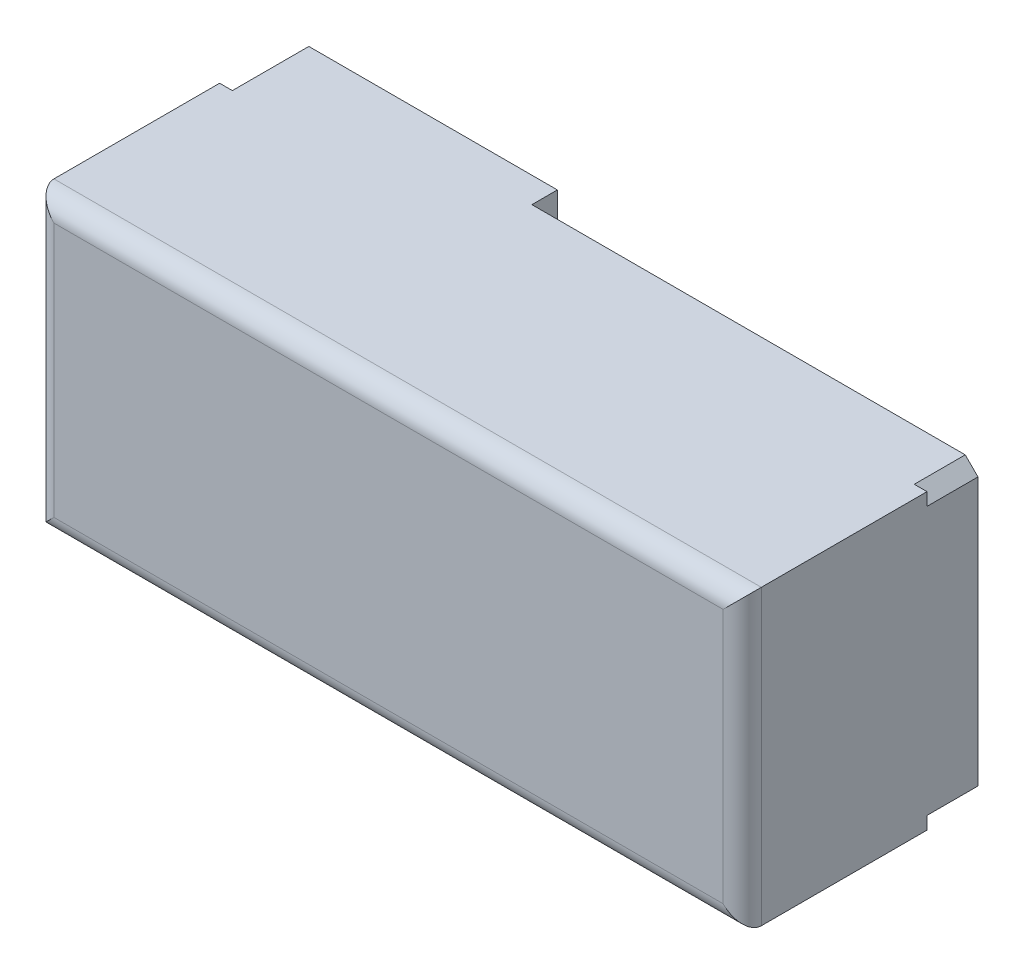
ISO-10303-21;
HEADER;
FILE_DESCRIPTION(('STEP AP214'),'2;1');
FILE_NAME('part.step','',(''),(''),'','','');
FILE_SCHEMA(('AUTOMOTIVE_DESIGN { 1 0 10303 214 1 1 1 1 }'));
ENDSEC;
DATA;
#1=APPLICATION_CONTEXT('core data for automotive mechanical design processes');
#2=APPLICATION_PROTOCOL_DEFINITION('international standard','automotive_design',2000,#1);
#3=PRODUCT_CONTEXT('',#1,'mechanical');
#4=PRODUCT('Part','Part','',(#3));
#5=PRODUCT_RELATED_PRODUCT_CATEGORY('part','',(#4));
#6=PRODUCT_DEFINITION_FORMATION('','',#4);
#7=PRODUCT_DEFINITION_CONTEXT('part definition',#1,'design');
#8=PRODUCT_DEFINITION('design','',#6,#7);
#9=PRODUCT_DEFINITION_SHAPE('','',#8);
#10=(LENGTH_UNIT() NAMED_UNIT(*) SI_UNIT(.MILLI.,.METRE.));
#11=(NAMED_UNIT(*) PLANE_ANGLE_UNIT() SI_UNIT($,.RADIAN.));
#12=(NAMED_UNIT(*) SI_UNIT($,.STERADIAN.) SOLID_ANGLE_UNIT());
#13=UNCERTAINTY_MEASURE_WITH_UNIT(LENGTH_MEASURE(1.E-05),#10,'distance_accuracy_value','');
#14=(GEOMETRIC_REPRESENTATION_CONTEXT(3) GLOBAL_UNCERTAINTY_ASSIGNED_CONTEXT((#13)) GLOBAL_UNIT_ASSIGNED_CONTEXT((#10,
#11,#12)) REPRESENTATION_CONTEXT('',''));
#15=CARTESIAN_POINT('',(0.,0.,0.));
#16=DIRECTION('',(0.,0.,1.));
#17=DIRECTION('',(1.,0.,0.));
#18=AXIS2_PLACEMENT_3D('',#15,#16,#17);
#19=CARTESIAN_POINT('',(55.5,-23.,8.));
#20=DIRECTION('',(-1.,0.,0.));
#21=DIRECTION('',(0.,0.,1.));
#22=AXIS2_PLACEMENT_3D('',#19,#20,#21);
#23=PLANE('',#22);
#24=DIRECTION('',(0.,0.,-1.));
#25=VECTOR('',#24,1.);
#26=CARTESIAN_POINT('',(55.4999999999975,22.9999999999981,37.));
#27=LINE('',#26,#25);
#28=CARTESIAN_POINT('',(55.4999999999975,22.9999999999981,34.));
#29=VERTEX_POINT('',#28);
#30=CARTESIAN_POINT('',(55.4999999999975,22.9999999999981,8.));
#31=VERTEX_POINT('',#30);
#32=EDGE_CURVE('E238',#29,#31,#27,.T.);
#33=ORIENTED_EDGE('',*,*,#32,.F.);
#34=DIRECTION('',(0.,1.,0.));
#35=VECTOR('',#34,1.);
#36=CARTESIAN_POINT('',(55.5,-22.9999999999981,34.));
#37=LINE('',#36,#35);
#38=CARTESIAN_POINT('',(55.4999999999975,-22.9999999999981,34.));
#39=VERTEX_POINT('',#38);
#40=EDGE_CURVE('E324',#29,#39,#37,.F.);
#41=ORIENTED_EDGE('',*,*,#40,.T.);
#42=DIRECTION('',(0.,0.,-1.));
#43=VECTOR('',#42,1.);
#44=CARTESIAN_POINT('',(55.4999999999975,-22.9999999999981,37.));
#45=LINE('',#44,#43);
#46=CARTESIAN_POINT('',(55.4999999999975,-22.9999999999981,8.));
#47=VERTEX_POINT('',#46);
#48=EDGE_CURVE('E181',#39,#47,#45,.T.);
#49=ORIENTED_EDGE('',*,*,#48,.T.);
#50=DIRECTION('',(0.,1.,0.));
#51=VECTOR('',#50,1.);
#52=CARTESIAN_POINT('',(55.4999999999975,22.9999999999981,8.));
#53=LINE('',#52,#51);
#54=CARTESIAN_POINT('',(55.5,-21.,8.));
#55=VERTEX_POINT('',#54);
#56=EDGE_CURVE('E203',#47,#55,#53,.T.);
#57=ORIENTED_EDGE('',*,*,#56,.T.);
#58=DIRECTION('',(0.,0.,-1.));
#59=VECTOR('',#58,1.);
#60=CARTESIAN_POINT('',(55.5,-21.,8.));
#61=LINE('',#60,#59);
#62=CARTESIAN_POINT('',(55.5,-21.,0.));
#63=VERTEX_POINT('',#62);
#64=EDGE_CURVE('E285',#55,#63,#61,.T.);
#65=ORIENTED_EDGE('',*,*,#64,.T.);
#66=DIRECTION('',(0.,1.,0.));
#67=VECTOR('',#66,1.);
#68=CARTESIAN_POINT('',(55.5,-23.,0.));
#69=LINE('',#68,#67);
#70=CARTESIAN_POINT('',(55.5,21.,0.));
#71=VERTEX_POINT('',#70);
#72=EDGE_CURVE('E438',#63,#71,#69,.T.);
#73=ORIENTED_EDGE('',*,*,#72,.T.);
#74=DIRECTION('',(0.,0.,1.));
#75=VECTOR('',#74,1.);
#76=CARTESIAN_POINT('',(55.5,21.,8.));
#77=LINE('',#76,#75);
#78=CARTESIAN_POINT('',(55.5,21.,8.));
#79=VERTEX_POINT('',#78);
#80=EDGE_CURVE('E290',#71,#79,#77,.T.);
#81=ORIENTED_EDGE('',*,*,#80,.T.);
#82=EDGE_CURVE('E197',#79,#31,#53,.T.);
#83=ORIENTED_EDGE('',*,*,#82,.T.);
#84=EDGE_LOOP('',(#33,#41,#49,#57,#65,#73,#81,#83));
#85=FACE_BOUND('',#84,.T.);
#86=ADVANCED_FACE('F38',(#85),#23,.F.);
#87=CARTESIAN_POINT('',(-55.5,23.,8.));
#88=DIRECTION('',(0.,-1.,0.));
#89=DIRECTION('',(1.,0.,0.));
#90=AXIS2_PLACEMENT_3D('',#87,#88,#89);
#91=PLANE('',#90);
#92=DIRECTION('',(0.,0.,-1.));
#93=VECTOR('',#92,1.);
#94=CARTESIAN_POINT('',(-55.4999999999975,22.9999999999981,37.));
#95=LINE('',#94,#93);
#96=CARTESIAN_POINT('',(-55.4999999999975,22.9999999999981,34.));
#97=VERTEX_POINT('',#96);
#98=CARTESIAN_POINT('',(-55.4999999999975,22.9999999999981,8.));
#99=VERTEX_POINT('',#98);
#100=EDGE_CURVE('E231',#97,#99,#95,.T.);
#101=ORIENTED_EDGE('',*,*,#100,.F.);
#102=DIRECTION('',(-1.,0.,0.));
#103=VECTOR('',#102,1.);
#104=CARTESIAN_POINT('',(55.4999999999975,23.,34.));
#105=LINE('',#104,#103);
#106=EDGE_CURVE('E328',#97,#29,#105,.F.);
#107=ORIENTED_EDGE('',*,*,#106,.T.);
#108=ORIENTED_EDGE('',*,*,#32,.T.);
#109=DIRECTION('',(-1.,0.,0.));
#110=VECTOR('',#109,1.);
#111=CARTESIAN_POINT('',(-55.4999999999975,22.9999999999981,8.));
#112=LINE('',#111,#110);
#113=CARTESIAN_POINT('',(53.5,23.,8.));
#114=VERTEX_POINT('',#113);
#115=EDGE_CURVE('E228',#31,#114,#112,.T.);
#116=ORIENTED_EDGE('',*,*,#115,.T.);
#117=DIRECTION('',(0.,0.,-1.));
#118=VECTOR('',#117,1.);
#119=CARTESIAN_POINT('',(53.5,23.,8.));
#120=LINE('',#119,#118);
#121=CARTESIAN_POINT('',(53.5,23.,0.));
#122=VERTEX_POINT('',#121);
#123=EDGE_CURVE('E289',#114,#122,#120,.T.);
#124=ORIENTED_EDGE('',*,*,#123,.T.);
#125=DIRECTION('',(-1.,0.,0.));
#126=VECTOR('',#125,1.);
#127=CARTESIAN_POINT('',(-55.5,23.,0.));
#128=LINE('',#127,#126);
#129=CARTESIAN_POINT('',(-14.5,23.,0.));
#130=VERTEX_POINT('',#129);
#131=EDGE_CURVE('E445',#122,#130,#128,.T.);
#132=ORIENTED_EDGE('',*,*,#131,.T.);
#133=DIRECTION('',(0.,0.,1.));
#134=VECTOR('',#133,1.);
#135=CARTESIAN_POINT('',(-14.5,23.,-4.));
#136=LINE('',#135,#134);
#137=CARTESIAN_POINT('',(-14.5,23.,-4.));
#138=VERTEX_POINT('',#137);
#139=EDGE_CURVE('E468',#138,#130,#136,.T.);
#140=ORIENTED_EDGE('',*,*,#139,.F.);
#141=DIRECTION('',(1.,0.,0.));
#142=VECTOR('',#141,1.);
#143=CARTESIAN_POINT('',(-14.5,23.,-4.));
#144=LINE('',#143,#142);
#145=CARTESIAN_POINT('',(-53.5,23.,-4.));
#146=VERTEX_POINT('',#145);
#147=EDGE_CURVE('E482',#146,#138,#144,.T.);
#148=ORIENTED_EDGE('',*,*,#147,.F.);
#149=DIRECTION('',(0.,0.,1.));
#150=VECTOR('',#149,1.);
#151=CARTESIAN_POINT('',(-53.5,23.,8.));
#152=LINE('',#151,#150);
#153=CARTESIAN_POINT('',(-53.5,23.,8.));
#154=VERTEX_POINT('',#153);
#155=EDGE_CURVE('E248',#146,#154,#152,.T.);
#156=ORIENTED_EDGE('',*,*,#155,.T.);
#157=EDGE_CURVE('E224',#154,#99,#112,.T.);
#158=ORIENTED_EDGE('',*,*,#157,.T.);
#159=EDGE_LOOP('',(#101,#107,#108,#116,#124,#132,#140,#148,#156,#158));
#160=FACE_BOUND('',#159,.T.);
#161=ADVANCED_FACE('F246',(#160),#91,.F.);
#162=CARTESIAN_POINT('',(-55.5,-23.,8.));
#163=DIRECTION('',(1.,0.,0.));
#164=DIRECTION('',(0.,0.,-1.));
#165=AXIS2_PLACEMENT_3D('',#162,#163,#164);
#166=PLANE('',#165);
#167=DIRECTION('',(0.,0.,-1.));
#168=VECTOR('',#167,1.);
#169=CARTESIAN_POINT('',(-55.4999999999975,-22.9999999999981,37.));
#170=LINE('',#169,#168);
#171=CARTESIAN_POINT('',(-55.4999999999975,-22.9999999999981,34.));
#172=VERTEX_POINT('',#171);
#173=CARTESIAN_POINT('',(-55.4999999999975,-22.9999999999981,8.));
#174=VERTEX_POINT('',#173);
#175=EDGE_CURVE('E174',#172,#174,#170,.T.);
#176=ORIENTED_EDGE('',*,*,#175,.F.);
#177=DIRECTION('',(0.,-1.,0.));
#178=VECTOR('',#177,1.);
#179=CARTESIAN_POINT('',(-55.5,22.9999999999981,34.));
#180=LINE('',#179,#178);
#181=EDGE_CURVE('E48',#172,#97,#180,.F.);
#182=ORIENTED_EDGE('',*,*,#181,.T.);
#183=ORIENTED_EDGE('',*,*,#100,.T.);
#184=DIRECTION('',(0.,-1.,0.));
#185=VECTOR('',#184,1.);
#186=CARTESIAN_POINT('',(-55.4999999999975,22.9999999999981,8.));
#187=LINE('',#186,#185);
#188=CARTESIAN_POINT('',(-55.4999999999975,21.0000000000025,8.));
#189=VERTEX_POINT('',#188);
#190=EDGE_CURVE('E192',#99,#189,#187,.T.);
#191=ORIENTED_EDGE('',*,*,#190,.T.);
#192=DIRECTION('',(0.,0.,-1.));
#193=VECTOR('',#192,1.);
#194=CARTESIAN_POINT('',(-55.5,21.,8.));
#195=LINE('',#194,#193);
#196=CARTESIAN_POINT('',(-55.5,21.,-4.));
#197=VERTEX_POINT('',#196);
#198=EDGE_CURVE('E308',#189,#197,#195,.T.);
#199=ORIENTED_EDGE('',*,*,#198,.T.);
#200=DIRECTION('',(0.,1.,0.));
#201=VECTOR('',#200,1.);
#202=CARTESIAN_POINT('',(-55.5,21.,-4.));
#203=LINE('',#202,#201);
#204=CARTESIAN_POINT('',(-55.5,-21.,-4.));
#205=VERTEX_POINT('',#204);
#206=EDGE_CURVE('E802',#205,#197,#203,.T.);
#207=ORIENTED_EDGE('',*,*,#206,.F.);
#208=DIRECTION('',(0.,0.,1.));
#209=VECTOR('',#208,1.);
#210=CARTESIAN_POINT('',(-55.5,-21.,8.));
#211=LINE('',#210,#209);
#212=CARTESIAN_POINT('',(-55.5,-21.,8.));
#213=VERTEX_POINT('',#212);
#214=EDGE_CURVE('E187',#205,#213,#211,.T.);
#215=ORIENTED_EDGE('',*,*,#214,.T.);
#216=EDGE_CURVE('E184',#213,#174,#187,.T.);
#217=ORIENTED_EDGE('',*,*,#216,.T.);
#218=EDGE_LOOP('',(#176,#182,#183,#191,#199,#207,#215,#217));
#219=FACE_BOUND('',#218,.T.);
#220=ADVANCED_FACE('F185',(#219),#166,.F.);
#221=CARTESIAN_POINT('',(-55.5,-23.,8.));
#222=DIRECTION('',(0.,1.,0.));
#223=DIRECTION('',(-1.,0.,0.));
#224=AXIS2_PLACEMENT_3D('',#221,#222,#223);
#225=PLANE('',#224);
#226=ORIENTED_EDGE('',*,*,#48,.F.);
#227=DIRECTION('',(1.,0.,0.));
#228=VECTOR('',#227,1.);
#229=CARTESIAN_POINT('',(-55.4999999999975,-23.,34.));
#230=LINE('',#229,#228);
#231=EDGE_CURVE('E11',#39,#172,#230,.F.);
#232=ORIENTED_EDGE('',*,*,#231,.T.);
#233=ORIENTED_EDGE('',*,*,#175,.T.);
#234=DIRECTION('',(1.,0.,0.));
#235=VECTOR('',#234,1.);
#236=CARTESIAN_POINT('',(-55.4999999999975,-22.9999999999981,8.));
#237=LINE('',#236,#235);
#238=CARTESIAN_POINT('',(-53.5,-23.,8.));
#239=VERTEX_POINT('',#238);
#240=EDGE_CURVE('E178',#174,#239,#237,.T.);
#241=ORIENTED_EDGE('',*,*,#240,.T.);
#242=DIRECTION('',(0.,0.,-1.));
#243=VECTOR('',#242,1.);
#244=CARTESIAN_POINT('',(-53.5,-23.,8.));
#245=LINE('',#244,#243);
#246=CARTESIAN_POINT('',(-53.5,-23.,-4.));
#247=VERTEX_POINT('',#246);
#248=EDGE_CURVE('E296',#239,#247,#245,.T.);
#249=ORIENTED_EDGE('',*,*,#248,.T.);
#250=DIRECTION('',(-1.,0.,0.));
#251=VECTOR('',#250,1.);
#252=CARTESIAN_POINT('',(-14.5,-23.,-4.));
#253=LINE('',#252,#251);
#254=CARTESIAN_POINT('',(-14.5,-23.,-4.));
#255=VERTEX_POINT('',#254);
#256=EDGE_CURVE('E794',#255,#247,#253,.T.);
#257=ORIENTED_EDGE('',*,*,#256,.F.);
#258=DIRECTION('',(0.,0.,1.));
#259=VECTOR('',#258,1.);
#260=CARTESIAN_POINT('',(-14.5,-23.,-4.));
#261=LINE('',#260,#259);
#262=CARTESIAN_POINT('',(-14.5,-23.,0.));
#263=VERTEX_POINT('',#262);
#264=EDGE_CURVE('E464',#255,#263,#261,.T.);
#265=ORIENTED_EDGE('',*,*,#264,.T.);
#266=DIRECTION('',(1.,0.,0.));
#267=VECTOR('',#266,1.);
#268=CARTESIAN_POINT('',(-55.5,-23.,0.));
#269=LINE('',#268,#267);
#270=CARTESIAN_POINT('',(53.5,-23.,0.));
#271=VERTEX_POINT('',#270);
#272=EDGE_CURVE('E297',#263,#271,#269,.T.);
#273=ORIENTED_EDGE('',*,*,#272,.T.);
#274=DIRECTION('',(0.,0.,1.));
#275=VECTOR('',#274,1.);
#276=CARTESIAN_POINT('',(53.5,-23.,8.));
#277=LINE('',#276,#275);
#278=CARTESIAN_POINT('',(53.5,-23.,8.));
#279=VERTEX_POINT('',#278);
#280=EDGE_CURVE('E293',#271,#279,#277,.T.);
#281=ORIENTED_EDGE('',*,*,#280,.T.);
#282=EDGE_CURVE('E198',#279,#47,#237,.T.);
#283=ORIENTED_EDGE('',*,*,#282,.T.);
#284=EDGE_LOOP('',(#226,#232,#233,#241,#249,#257,#265,#273,#281,#283));
#285=FACE_BOUND('',#284,.T.);
#286=ADVANCED_FACE('F176',(#285),#225,.F.);
#287=CARTESIAN_POINT('',(55.5,23.,0.));
#288=DIRECTION('',(0.,0.,-1.));
#289=DIRECTION('',(-1.,0.,0.));
#290=AXIS2_PLACEMENT_3D('',#287,#288,#289);
#291=PLANE('',#290);
#292=DIRECTION('',(0.,-1.,0.));
#293=VECTOR('',#292,1.);
#294=CARTESIAN_POINT('',(-14.5,23.,0.));
#295=LINE('',#294,#293);
#296=EDGE_CURVE('E471',#130,#263,#295,.T.);
#297=ORIENTED_EDGE('',*,*,#296,.F.);
#298=ORIENTED_EDGE('',*,*,#131,.F.);
#299=DIRECTION('',(-0.707106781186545,0.70710678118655,0.));
#300=VECTOR('',#299,1.);
#301=CARTESIAN_POINT('',(54.5,22.,0.));
#302=LINE('',#301,#300);
#303=EDGE_CURVE('E303',#122,#71,#302,.F.);
#304=ORIENTED_EDGE('',*,*,#303,.T.);
#305=ORIENTED_EDGE('',*,*,#72,.F.);
#306=DIRECTION('',(0.70710678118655,0.707106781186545,0.));
#307=VECTOR('',#306,1.);
#308=CARTESIAN_POINT('',(77.5,0.999999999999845,0.));
#309=LINE('',#308,#307);
#310=EDGE_CURVE('E435',#63,#271,#309,.F.);
#311=ORIENTED_EDGE('',*,*,#310,.T.);
#312=ORIENTED_EDGE('',*,*,#272,.F.);
#313=EDGE_LOOP('',(#297,#298,#304,#305,#311,#312));
#314=FACE_BOUND('',#313,.T.);
#315=CARTESIAN_POINT('',(19.,0.,0.));
#316=DIRECTION('',(0.,0.,1.));
#317=DIRECTION('',(1.,0.,0.));
#318=AXIS2_PLACEMENT_3D('',#315,#316,#317);
#319=CIRCLE('',#318,5.);
#320=CARTESIAN_POINT('',(19.,5.,0.));
#321=VERTEX_POINT('',#320);
#322=CARTESIAN_POINT('',(19.,-5.,0.));
#323=VERTEX_POINT('',#322);
#324=EDGE_CURVE('E484',#321,#323,#319,.T.);
#325=ORIENTED_EDGE('',*,*,#324,.T.);
#326=DIRECTION('',(1.,0.,0.));
#327=VECTOR('',#326,1.);
#328=CARTESIAN_POINT('',(19.,-5.,0.));
#329=LINE('',#328,#327);
#330=CARTESIAN_POINT('',(29.,-5.,0.));
#331=VERTEX_POINT('',#330);
#332=EDGE_CURVE('E488',#323,#331,#329,.T.);
#333=ORIENTED_EDGE('',*,*,#332,.T.);
#334=CARTESIAN_POINT('',(29.,0.,0.));
#335=DIRECTION('',(0.,0.,1.));
#336=DIRECTION('',(1.,0.,0.));
#337=AXIS2_PLACEMENT_3D('',#334,#335,#336);
#338=CIRCLE('',#337,5.);
#339=CARTESIAN_POINT('',(29.,5.,0.));
#340=VERTEX_POINT('',#339);
#341=EDGE_CURVE('E493',#331,#340,#338,.T.);
#342=ORIENTED_EDGE('',*,*,#341,.T.);
#343=DIRECTION('',(-1.,0.,0.));
#344=VECTOR('',#343,1.);
#345=CARTESIAN_POINT('',(19.,5.,0.));
#346=LINE('',#345,#344);
#347=EDGE_CURVE('E497',#340,#321,#346,.T.);
#348=ORIENTED_EDGE('',*,*,#347,.T.);
#349=EDGE_LOOP('',(#325,#333,#342,#348));
#350=FACE_BOUND('',#349,.T.);
#351=ADVANCED_FACE('F441',(#314,#350),#291,.T.);
#352=CARTESIAN_POINT('',(-34.5,0.,0.));
#353=DIRECTION('',(0.,0.,1.));
#354=DIRECTION('',(1.,0.,0.));
#355=AXIS2_PLACEMENT_3D('',#352,#353,#354);
#356=CYLINDRICAL_SURFACE('',#355,7.5);
#357=CARTESIAN_POINT('',(-34.5,0.,0.));
#358=DIRECTION('',(0.,0.,1.));
#359=DIRECTION('',(1.,0.,0.));
#360=AXIS2_PLACEMENT_3D('',#357,#358,#359);
#361=CIRCLE('',#360,7.5);
#362=CARTESIAN_POINT('',(-27.,0.,0.));
#363=VERTEX_POINT('',#362);
#364=EDGE_CURVE('E477',#363,#363,#361,.F.);
#365=ORIENTED_EDGE('',*,*,#364,.T.);
#366=EDGE_LOOP('',(#365));
#367=FACE_BOUND('',#366,.T.);
#368=CARTESIAN_POINT('',(-34.5,0.,8.));
#369=DIRECTION('',(0.,0.,1.));
#370=DIRECTION('',(1.,0.,0.));
#371=AXIS2_PLACEMENT_3D('',#368,#369,#370);
#372=CIRCLE('',#371,7.5);
#373=CARTESIAN_POINT('',(-27.,0.,8.));
#374=VERTEX_POINT('',#373);
#375=EDGE_CURVE('E180',#374,#374,#372,.T.);
#376=ORIENTED_EDGE('',*,*,#375,.T.);
#377=EDGE_LOOP('',(#376));
#378=FACE_BOUND('',#377,.T.);
#379=ADVANCED_FACE('F542',(#367,#378),#356,.F.);
#380=CARTESIAN_POINT('',(19.,0.,0.));
#381=DIRECTION('',(0.,0.,1.));
#382=DIRECTION('',(1.,0.,0.));
#383=AXIS2_PLACEMENT_3D('',#380,#381,#382);
#384=CYLINDRICAL_SURFACE('',#383,5.);
#385=CARTESIAN_POINT('',(19.,0.,8.));
#386=DIRECTION('',(0.,0.,1.));
#387=DIRECTION('',(1.,0.,0.));
#388=AXIS2_PLACEMENT_3D('',#385,#386,#387);
#389=CIRCLE('',#388,5.);
#390=CARTESIAN_POINT('',(19.,5.,8.));
#391=VERTEX_POINT('',#390);
#392=CARTESIAN_POINT('',(19.,-5.,8.));
#393=VERTEX_POINT('',#392);
#394=EDGE_CURVE('E467',#391,#393,#389,.T.);
#395=ORIENTED_EDGE('',*,*,#394,.T.);
#396=DIRECTION('',(0.,0.,1.));
#397=VECTOR('',#396,1.);
#398=CARTESIAN_POINT('',(19.,-5.,0.));
#399=LINE('',#398,#397);
#400=EDGE_CURVE('E501',#323,#393,#399,.T.);
#401=ORIENTED_EDGE('',*,*,#400,.F.);
#402=ORIENTED_EDGE('',*,*,#324,.F.);
#403=DIRECTION('',(0.,0.,1.));
#404=VECTOR('',#403,1.);
#405=CARTESIAN_POINT('',(19.,5.,0.));
#406=LINE('',#405,#404);
#407=EDGE_CURVE('E446',#321,#391,#406,.T.);
#408=ORIENTED_EDGE('',*,*,#407,.T.);
#409=EDGE_LOOP('',(#395,#401,#402,#408));
#410=FACE_BOUND('',#409,.T.);
#411=ADVANCED_FACE('F529',(#410),#384,.F.);
#412=CARTESIAN_POINT('',(19.,5.,0.));
#413=DIRECTION('',(0.,1.,0.));
#414=DIRECTION('',(0.,0.,1.));
#415=AXIS2_PLACEMENT_3D('',#412,#413,#414);
#416=PLANE('',#415);
#417=DIRECTION('',(-1.,0.,0.));
#418=VECTOR('',#417,1.);
#419=CARTESIAN_POINT('',(19.,5.,8.));
#420=LINE('',#419,#418);
#421=CARTESIAN_POINT('',(29.,5.,8.));
#422=VERTEX_POINT('',#421);
#423=EDGE_CURVE('E489',#422,#391,#420,.T.);
#424=ORIENTED_EDGE('',*,*,#423,.T.);
#425=ORIENTED_EDGE('',*,*,#407,.F.);
#426=ORIENTED_EDGE('',*,*,#347,.F.);
#427=DIRECTION('',(0.,0.,1.));
#428=VECTOR('',#427,1.);
#429=CARTESIAN_POINT('',(29.,5.,0.));
#430=LINE('',#429,#428);
#431=EDGE_CURVE('E454',#340,#422,#430,.T.);
#432=ORIENTED_EDGE('',*,*,#431,.T.);
#433=EDGE_LOOP('',(#424,#425,#426,#432));
#434=FACE_BOUND('',#433,.T.);
#435=ADVANCED_FACE('F534',(#434),#416,.F.);
#436=CARTESIAN_POINT('',(29.,0.,0.));
#437=DIRECTION('',(0.,0.,1.));
#438=DIRECTION('',(1.,0.,0.));
#439=AXIS2_PLACEMENT_3D('',#436,#437,#438);
#440=CYLINDRICAL_SURFACE('',#439,5.);
#441=CARTESIAN_POINT('',(29.,0.,8.));
#442=DIRECTION('',(0.,0.,1.));
#443=DIRECTION('',(1.,0.,0.));
#444=AXIS2_PLACEMENT_3D('',#441,#442,#443);
#445=CIRCLE('',#444,5.);
#446=CARTESIAN_POINT('',(29.,-5.,8.));
#447=VERTEX_POINT('',#446);
#448=EDGE_CURVE('E509',#447,#422,#445,.T.);
#449=ORIENTED_EDGE('',*,*,#448,.T.);
#450=ORIENTED_EDGE('',*,*,#431,.F.);
#451=ORIENTED_EDGE('',*,*,#341,.F.);
#452=DIRECTION('',(0.,0.,1.));
#453=VECTOR('',#452,1.);
#454=CARTESIAN_POINT('',(29.,-5.,0.));
#455=LINE('',#454,#453);
#456=EDGE_CURVE('E519',#331,#447,#455,.T.);
#457=ORIENTED_EDGE('',*,*,#456,.T.);
#458=EDGE_LOOP('',(#449,#450,#451,#457));
#459=FACE_BOUND('',#458,.T.);
#460=ADVANCED_FACE('F531',(#459),#440,.F.);
#461=CARTESIAN_POINT('',(19.,-5.,0.));
#462=DIRECTION('',(0.,-1.,0.));
#463=DIRECTION('',(0.,0.,-1.));
#464=AXIS2_PLACEMENT_3D('',#461,#462,#463);
#465=PLANE('',#464);
#466=DIRECTION('',(1.,0.,0.));
#467=VECTOR('',#466,1.);
#468=CARTESIAN_POINT('',(19.,-5.,8.));
#469=LINE('',#468,#467);
#470=EDGE_CURVE('E505',#393,#447,#469,.T.);
#471=ORIENTED_EDGE('',*,*,#470,.T.);
#472=ORIENTED_EDGE('',*,*,#456,.F.);
#473=ORIENTED_EDGE('',*,*,#332,.F.);
#474=ORIENTED_EDGE('',*,*,#400,.T.);
#475=EDGE_LOOP('',(#471,#472,#473,#474));
#476=FACE_BOUND('',#475,.T.);
#477=ADVANCED_FACE('F389',(#476),#465,.F.);
#478=CARTESIAN_POINT('',(-53.5,-23.,8.));
#479=DIRECTION('',(0.70710678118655,0.707106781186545,0.));
#480=DIRECTION('',(-0.707106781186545,0.70710678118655,0.));
#481=AXIS2_PLACEMENT_3D('',#478,#479,#480);
#482=PLANE('',#481);
#483=DIRECTION('',(-0.707106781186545,0.70710678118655,0.));
#484=VECTOR('',#483,1.);
#485=CARTESIAN_POINT('',(-53.5,-23.,8.));
#486=LINE('',#485,#484);
#487=EDGE_CURVE('E195',#213,#239,#486,.F.);
#488=ORIENTED_EDGE('',*,*,#487,.F.);
#489=ORIENTED_EDGE('',*,*,#214,.F.);
#490=DIRECTION('',(-0.707106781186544,0.707106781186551,0.));
#491=VECTOR('',#490,1.);
#492=CARTESIAN_POINT('',(-55.5,-21.,-4.));
#493=LINE('',#492,#491);
#494=EDGE_CURVE('E798',#247,#205,#493,.T.);
#495=ORIENTED_EDGE('',*,*,#494,.F.);
#496=ORIENTED_EDGE('',*,*,#248,.F.);
#497=EDGE_LOOP('',(#488,#489,#495,#496));
#498=FACE_BOUND('',#497,.T.);
#499=ADVANCED_FACE('F385',(#498),#482,.F.);
#500=CARTESIAN_POINT('',(55.5,-21.,8.));
#501=DIRECTION('',(-0.707106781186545,0.70710678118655,0.));
#502=DIRECTION('',(-0.70710678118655,-0.707106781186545,0.));
#503=AXIS2_PLACEMENT_3D('',#500,#501,#502);
#504=PLANE('',#503);
#505=DIRECTION('',(-0.70710678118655,-0.707106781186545,0.));
#506=VECTOR('',#505,1.);
#507=CARTESIAN_POINT('',(55.5,-21.,8.));
#508=LINE('',#507,#506);
#509=EDGE_CURVE('E256',#279,#55,#508,.F.);
#510=ORIENTED_EDGE('',*,*,#509,.F.);
#511=ORIENTED_EDGE('',*,*,#280,.F.);
#512=ORIENTED_EDGE('',*,*,#310,.F.);
#513=ORIENTED_EDGE('',*,*,#64,.F.);
#514=EDGE_LOOP('',(#510,#511,#512,#513));
#515=FACE_BOUND('',#514,.T.);
#516=ADVANCED_FACE('F388',(#515),#504,.F.);
#517=CARTESIAN_POINT('',(-55.5,21.,8.));
#518=DIRECTION('',(0.707106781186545,-0.70710678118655,0.));
#519=DIRECTION('',(0.70710678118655,0.707106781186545,0.));
#520=AXIS2_PLACEMENT_3D('',#517,#518,#519);
#521=PLANE('',#520);
#522=DIRECTION('',(0.70710678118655,0.707106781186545,0.));
#523=VECTOR('',#522,1.);
#524=CARTESIAN_POINT('',(-55.5,21.,8.));
#525=LINE('',#524,#523);
#526=EDGE_CURVE('E253',#154,#189,#525,.F.);
#527=ORIENTED_EDGE('',*,*,#526,.F.);
#528=ORIENTED_EDGE('',*,*,#155,.F.);
#529=DIRECTION('',(0.707106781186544,0.707106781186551,0.));
#530=VECTOR('',#529,1.);
#531=CARTESIAN_POINT('',(-55.5,21.,-4.));
#532=LINE('',#531,#530);
#533=EDGE_CURVE('E805',#197,#146,#532,.T.);
#534=ORIENTED_EDGE('',*,*,#533,.F.);
#535=ORIENTED_EDGE('',*,*,#198,.F.);
#536=EDGE_LOOP('',(#527,#528,#534,#535));
#537=FACE_BOUND('',#536,.T.);
#538=ADVANCED_FACE('F393',(#537),#521,.F.);
#539=CARTESIAN_POINT('',(53.5,23.,8.));
#540=DIRECTION('',(-0.70710678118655,-0.707106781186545,0.));
#541=DIRECTION('',(0.707106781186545,-0.70710678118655,0.));
#542=AXIS2_PLACEMENT_3D('',#539,#540,#541);
#543=PLANE('',#542);
#544=DIRECTION('',(0.707106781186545,-0.70710678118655,0.));
#545=VECTOR('',#544,1.);
#546=CARTESIAN_POINT('',(53.5,23.,8.));
#547=LINE('',#546,#545);
#548=EDGE_CURVE('E257',#79,#114,#547,.F.);
#549=ORIENTED_EDGE('',*,*,#548,.F.);
#550=ORIENTED_EDGE('',*,*,#80,.F.);
#551=ORIENTED_EDGE('',*,*,#303,.F.);
#552=ORIENTED_EDGE('',*,*,#123,.F.);
#553=EDGE_LOOP('',(#549,#550,#551,#552));
#554=FACE_BOUND('',#553,.T.);
#555=ADVANCED_FACE('F397',(#554),#543,.F.);
#556=CARTESIAN_POINT('',(0.,0.,-4.));
#557=DIRECTION('',(0.,0.,-1.));
#558=DIRECTION('',(-1.,0.,0.));
#559=AXIS2_PLACEMENT_3D('',#556,#557,#558);
#560=PLANE('',#559);
#561=CARTESIAN_POINT('',(-34.5,0.,-4.));
#562=DIRECTION('',(0.,0.,-1.));
#563=DIRECTION('',(-1.,0.,0.));
#564=AXIS2_PLACEMENT_3D('',#561,#562,#563);
#565=CIRCLE('',#564,15.1);
#566=CARTESIAN_POINT('',(-49.6,0.,-4.));
#567=VERTEX_POINT('',#566);
#568=EDGE_CURVE('E784',#567,#567,#565,.T.);
#569=ORIENTED_EDGE('',*,*,#568,.F.);
#570=EDGE_LOOP('',(#569));
#571=FACE_BOUND('',#570,.T.);
#572=DIRECTION('',(0.,-1.,0.));
#573=VECTOR('',#572,1.);
#574=CARTESIAN_POINT('',(-14.5,23.,-4.));
#575=LINE('',#574,#573);
#576=EDGE_CURVE('E476',#138,#255,#575,.T.);
#577=ORIENTED_EDGE('',*,*,#576,.T.);
#578=ORIENTED_EDGE('',*,*,#256,.T.);
#579=ORIENTED_EDGE('',*,*,#494,.T.);
#580=ORIENTED_EDGE('',*,*,#206,.T.);
#581=ORIENTED_EDGE('',*,*,#533,.T.);
#582=ORIENTED_EDGE('',*,*,#147,.T.);
#583=EDGE_LOOP('',(#577,#578,#579,#580,#581,#582));
#584=FACE_BOUND('',#583,.T.);
#585=ADVANCED_FACE('F400',(#571,#584),#560,.T.);
#586=CARTESIAN_POINT('',(-14.5,23.,-4.));
#587=DIRECTION('',(-1.,0.,0.));
#588=DIRECTION('',(0.,-1.,0.));
#589=AXIS2_PLACEMENT_3D('',#586,#587,#588);
#590=PLANE('',#589);
#591=ORIENTED_EDGE('',*,*,#296,.T.);
#592=ORIENTED_EDGE('',*,*,#264,.F.);
#593=ORIENTED_EDGE('',*,*,#576,.F.);
#594=ORIENTED_EDGE('',*,*,#139,.T.);
#595=EDGE_LOOP('',(#591,#592,#593,#594));
#596=FACE_BOUND('',#595,.T.);
#597=ADVANCED_FACE('F545',(#596),#590,.F.);
#598=CARTESIAN_POINT('',(-34.5,0.,0.));
#599=DIRECTION('',(0.,0.,1.));
#600=DIRECTION('',(1.,0.,0.));
#601=AXIS2_PLACEMENT_3D('',#598,#599,#600);
#602=PLANE('',#601);
#603=CARTESIAN_POINT('',(-34.5,0.,0.));
#604=DIRECTION('',(0.,0.,1.));
#605=DIRECTION('',(1.,0.,0.));
#606=AXIS2_PLACEMENT_3D('',#603,#604,#605);
#607=CIRCLE('',#606,15.1);
#608=CARTESIAN_POINT('',(-19.4,0.,0.));
#609=VERTEX_POINT('',#608);
#610=EDGE_CURVE('E780',#609,#609,#607,.T.);
#611=ORIENTED_EDGE('',*,*,#610,.F.);
#612=EDGE_LOOP('',(#611));
#613=FACE_BOUND('',#612,.T.);
#614=ORIENTED_EDGE('',*,*,#364,.F.);
#615=EDGE_LOOP('',(#614));
#616=FACE_BOUND('',#615,.T.);
#617=ADVANCED_FACE('F374',(#613,#616),#602,.F.);
#618=CARTESIAN_POINT('',(-34.5,0.,-4.000025));
#619=DIRECTION('',(0.,0.,1.));
#620=DIRECTION('',(1.,0.,0.));
#621=AXIS2_PLACEMENT_3D('',#618,#619,#620);
#622=CYLINDRICAL_SURFACE('',#621,15.1);
#623=ORIENTED_EDGE('',*,*,#568,.T.);
#624=EDGE_LOOP('',(#623));
#625=FACE_BOUND('',#624,.T.);
#626=ORIENTED_EDGE('',*,*,#610,.T.);
#627=EDGE_LOOP('',(#626));
#628=FACE_BOUND('',#627,.T.);
#629=ADVANCED_FACE('F365',(#625,#628),#622,.F.);
#630=CARTESIAN_POINT('',(0.,0.,37.));
#631=DIRECTION('',(0.,0.,1.));
#632=DIRECTION('',(1.,0.,0.));
#633=AXIS2_PLACEMENT_3D('',#630,#631,#632);
#634=PLANE('',#633);
#635=DIRECTION('',(1.,0.,0.));
#636=VECTOR('',#635,1.);
#637=CARTESIAN_POINT('',(55.4999999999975,-20.,37.));
#638=LINE('',#637,#636);
#639=CARTESIAN_POINT('',(-52.5,-20.,37.));
#640=VERTEX_POINT('',#639);
#641=CARTESIAN_POINT('',(52.5,-20.,37.));
#642=VERTEX_POINT('',#641);
#643=EDGE_CURVE('E311',#640,#642,#638,.T.);
#644=ORIENTED_EDGE('',*,*,#643,.T.);
#645=DIRECTION('',(0.,1.,0.));
#646=VECTOR('',#645,1.);
#647=CARTESIAN_POINT('',(52.5,22.9999999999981,37.));
#648=LINE('',#647,#646);
#649=CARTESIAN_POINT('',(52.5,20.,37.));
#650=VERTEX_POINT('',#649);
#651=EDGE_CURVE('E320',#642,#650,#648,.T.);
#652=ORIENTED_EDGE('',*,*,#651,.T.);
#653=DIRECTION('',(-1.,0.,0.));
#654=VECTOR('',#653,1.);
#655=CARTESIAN_POINT('',(-55.4999999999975,20.,37.));
#656=LINE('',#655,#654);
#657=CARTESIAN_POINT('',(-52.5,20.,37.));
#658=VERTEX_POINT('',#657);
#659=EDGE_CURVE('E317',#650,#658,#656,.T.);
#660=ORIENTED_EDGE('',*,*,#659,.T.);
#661=DIRECTION('',(0.,-1.,0.));
#662=VECTOR('',#661,1.);
#663=CARTESIAN_POINT('',(-52.5,-22.9999999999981,37.));
#664=LINE('',#663,#662);
#665=EDGE_CURVE('E314',#658,#640,#664,.T.);
#666=ORIENTED_EDGE('',*,*,#665,.T.);
#667=EDGE_LOOP('',(#644,#652,#660,#666));
#668=FACE_BOUND('',#667,.T.);
#669=ADVANCED_FACE('F363',(#668),#634,.T.);
#670=CARTESIAN_POINT('',(0.,0.,8.));
#671=DIRECTION('',(0.,0.,1.));
#672=DIRECTION('',(1.,0.,0.));
#673=AXIS2_PLACEMENT_3D('',#670,#671,#672);
#674=PLANE('',#673);
#675=ORIENTED_EDGE('',*,*,#157,.F.);
#676=ORIENTED_EDGE('',*,*,#526,.T.);
#677=ORIENTED_EDGE('',*,*,#190,.F.);
#678=EDGE_LOOP('',(#675,#676,#677));
#679=FACE_BOUND('',#678,.T.);
#680=ADVANCED_FACE('F252',(#679),#674,.F.);
#681=ORIENTED_EDGE('',*,*,#82,.F.);
#682=ORIENTED_EDGE('',*,*,#548,.T.);
#683=ORIENTED_EDGE('',*,*,#115,.F.);
#684=EDGE_LOOP('',(#681,#682,#683));
#685=FACE_BOUND('',#684,.T.);
#686=ADVANCED_FACE('F371',(#685),#674,.F.);
#687=ORIENTED_EDGE('',*,*,#282,.F.);
#688=ORIENTED_EDGE('',*,*,#509,.T.);
#689=ORIENTED_EDGE('',*,*,#56,.F.);
#690=EDGE_LOOP('',(#687,#688,#689));
#691=FACE_BOUND('',#690,.T.);
#692=ADVANCED_FACE('F420',(#691),#674,.F.);
#693=ORIENTED_EDGE('',*,*,#216,.F.);
#694=ORIENTED_EDGE('',*,*,#487,.T.);
#695=ORIENTED_EDGE('',*,*,#240,.F.);
#696=EDGE_LOOP('',(#693,#694,#695));
#697=FACE_BOUND('',#696,.T.);
#698=ADVANCED_FACE('F194',(#697),#674,.F.);
#699=ORIENTED_EDGE('',*,*,#375,.F.);
#700=EDGE_LOOP('',(#699));
#701=FACE_BOUND('',#700,.T.);
#702=ADVANCED_FACE('F373',(#701),#674,.F.);
#703=ORIENTED_EDGE('',*,*,#470,.F.);
#704=ORIENTED_EDGE('',*,*,#394,.F.);
#705=ORIENTED_EDGE('',*,*,#423,.F.);
#706=ORIENTED_EDGE('',*,*,#448,.F.);
#707=EDGE_LOOP('',(#703,#704,#705,#706));
#708=FACE_BOUND('',#707,.T.);
#709=ADVANCED_FACE('F409',(#708),#674,.F.);
#710=CARTESIAN_POINT('',(-52.5,0.,34.));
#711=DIRECTION('',(0.,1.,0.));
#712=DIRECTION('',(0.,0.,1.));
#713=AXIS2_PLACEMENT_3D('',#710,#711,#712);
#714=CYLINDRICAL_SURFACE('',#713,3.);
#715=CARTESIAN_POINT('',(-52.5,20.,34.));
#716=DIRECTION('',(0.707106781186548,0.707106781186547,0.));
#717=DIRECTION('',(-0.707106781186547,0.707106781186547,0.));
#718=AXIS2_PLACEMENT_3D('',#715,#716,#717);
#719=ELLIPSE('',#718,4.24264068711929,3.);
#720=EDGE_CURVE('E337',#97,#658,#719,.T.);
#721=ORIENTED_EDGE('',*,*,#720,.F.);
#722=ORIENTED_EDGE('',*,*,#181,.F.);
#723=CARTESIAN_POINT('',(-52.5,-20.,34.));
#724=DIRECTION('',(-0.707106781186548,0.707106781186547,0.));
#725=DIRECTION('',(-0.707106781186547,-0.707106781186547,0.));
#726=AXIS2_PLACEMENT_3D('',#723,#724,#725);
#727=ELLIPSE('',#726,4.24264068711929,3.);
#728=EDGE_CURVE('E42',#640,#172,#727,.F.);
#729=ORIENTED_EDGE('',*,*,#728,.F.);
#730=ORIENTED_EDGE('',*,*,#665,.F.);
#731=EDGE_LOOP('',(#721,#722,#729,#730));
#732=FACE_BOUND('',#731,.T.);
#733=ADVANCED_FACE('F40',(#732),#714,.T.);
#734=CARTESIAN_POINT('',(0.,-20.,34.));
#735=DIRECTION('',(-1.,0.,0.));
#736=DIRECTION('',(0.,-1.,0.));
#737=AXIS2_PLACEMENT_3D('',#734,#735,#736);
#738=CYLINDRICAL_SURFACE('',#737,3.);
#739=ORIENTED_EDGE('',*,*,#728,.T.);
#740=ORIENTED_EDGE('',*,*,#231,.F.);
#741=CARTESIAN_POINT('',(52.5,-20.,34.));
#742=DIRECTION('',(-0.707106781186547,-0.707106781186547,0.));
#743=DIRECTION('',(-0.707106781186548,0.707106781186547,0.));
#744=AXIS2_PLACEMENT_3D('',#741,#742,#743);
#745=ELLIPSE('',#744,4.24264068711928,3.);
#746=EDGE_CURVE('E335',#642,#39,#745,.F.);
#747=ORIENTED_EDGE('',*,*,#746,.F.);
#748=ORIENTED_EDGE('',*,*,#643,.F.);
#749=EDGE_LOOP('',(#739,#740,#747,#748));
#750=FACE_BOUND('',#749,.T.);
#751=ADVANCED_FACE('F348',(#750),#738,.T.);
#752=CARTESIAN_POINT('',(0.,20.,34.));
#753=DIRECTION('',(1.,0.,0.));
#754=DIRECTION('',(0.,1.,0.));
#755=AXIS2_PLACEMENT_3D('',#752,#753,#754);
#756=CYLINDRICAL_SURFACE('',#755,3.);
#757=ORIENTED_EDGE('',*,*,#720,.T.);
#758=ORIENTED_EDGE('',*,*,#659,.F.);
#759=CARTESIAN_POINT('',(52.5,20.,34.));
#760=DIRECTION('',(0.707106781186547,-0.707106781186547,0.));
#761=DIRECTION('',(0.707106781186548,0.707106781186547,0.));
#762=AXIS2_PLACEMENT_3D('',#759,#760,#761);
#763=ELLIPSE('',#762,4.24264068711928,3.);
#764=EDGE_CURVE('E332',#29,#650,#763,.T.);
#765=ORIENTED_EDGE('',*,*,#764,.F.);
#766=ORIENTED_EDGE('',*,*,#106,.F.);
#767=EDGE_LOOP('',(#757,#758,#765,#766));
#768=FACE_BOUND('',#767,.T.);
#769=ADVANCED_FACE('F353',(#768),#756,.T.);
#770=CARTESIAN_POINT('',(52.5,0.,34.));
#771=DIRECTION('',(0.,-1.,0.));
#772=DIRECTION('',(0.,0.,-1.));
#773=AXIS2_PLACEMENT_3D('',#770,#771,#772);
#774=CYLINDRICAL_SURFACE('',#773,3.);
#775=ORIENTED_EDGE('',*,*,#746,.T.);
#776=ORIENTED_EDGE('',*,*,#40,.F.);
#777=ORIENTED_EDGE('',*,*,#764,.T.);
#778=ORIENTED_EDGE('',*,*,#651,.F.);
#779=EDGE_LOOP('',(#775,#776,#777,#778));
#780=FACE_BOUND('',#779,.T.);
#781=ADVANCED_FACE('F360',(#780),#774,.T.);
#782=CLOSED_SHELL('',(#86,#161,#220,#286,#351,#379,#411,#435,#460,#477,#499,#516,#538,#555,#585,
#597,#617,#629,#669,#680,#686,#692,#698,#702,#709,#733,#751,#769,#781));
#783=MANIFOLD_SOLID_BREP('B2',#782);
#784=ADVANCED_BREP_SHAPE_REPRESENTATION('',(#18,#783),#14);
#785=SHAPE_DEFINITION_REPRESENTATION(#9,#784);
ENDSEC;
END-ISO-10303-21;
